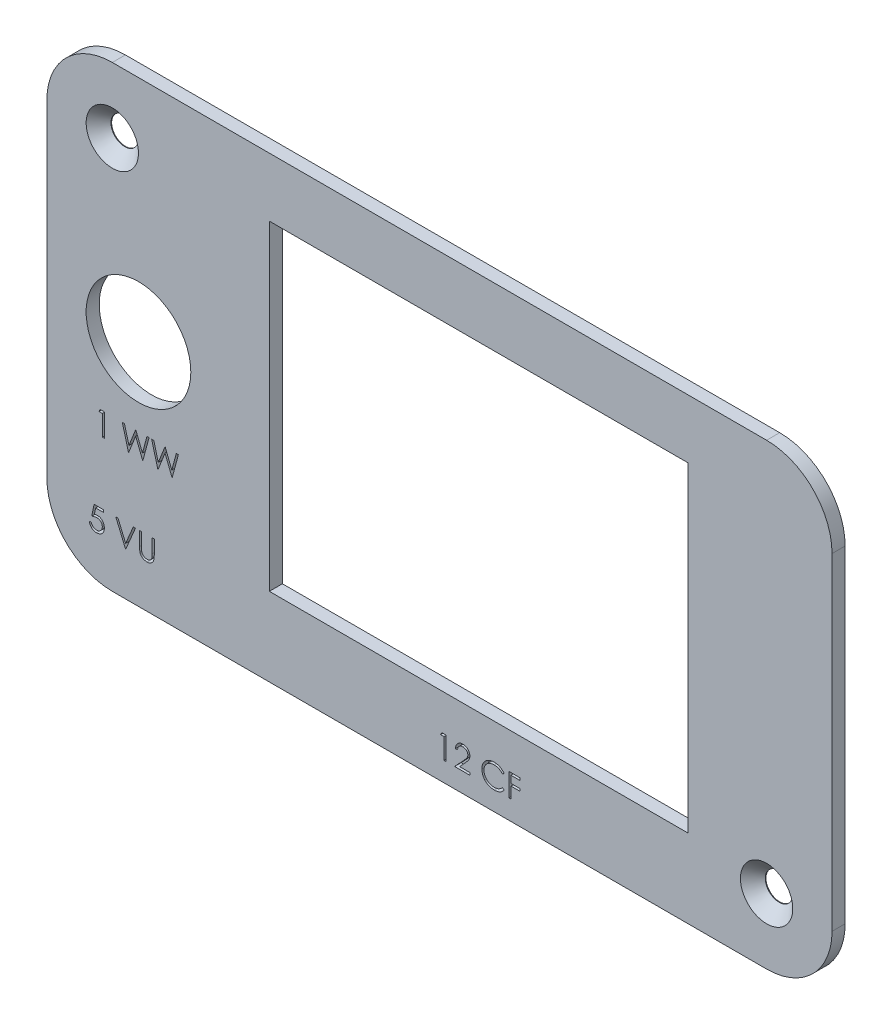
from build123d import *

# Parameters (mm, degrees)
ESQUISSE1_W             = 120
ESQUISSE1_H             = 70
BOSS_EXTRU_1_DEPTH      = 2
CONG_1_R                = 10
ESQUISSE2_R             = 2.1
ENL_V_MAT_EXTRU_1_DEPTH = 139.938835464
ESQUISSE3_R             = 8
ESQUISSE3_W             = 64
ESQUISSE3_H             = 49
ENL_V_MAT_EXTRU_3_DEPTH = 139.938835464
CHANFREIN1_SIZE         = 1.9
ENL_V_MAT_EXTRU_4_DEPTH = 1


with BuildPart() as part:
    # Esquisse1 → Boss.-Extru.1 (new body)
    with BuildSketch(Plane.XY):
        with Locations((60, 35)):
            Rectangle(ESQUISSE1_W, ESQUISSE1_H)
    extrude(amount=BOSS_EXTRU_1_DEPTH)

    # Cong_1
    cong_1_edges = [part.edges().sort_by_distance(p)[0] for p in [
        (0, 70, 1),
        (120, 70, 1),
        (120, 0, 1),
        (0, 0, 1),
    ]]
    fillet(cong_1_edges, radius=CONG_1_R)

    # Esquisse2 → Enl_v. mat.-Extru.1 (cut, through all)
    with BuildSketch(Plane.XY.offset(2)):
        with Locations((10, 60)):
            Circle(ESQUISSE2_R)
        with Locations((110, 10)):
            Circle(ESQUISSE2_R)
    extrude(amount=-ENL_V_MAT_EXTRU_1_DEPTH, mode=Mode.SUBTRACT)

    # Esquisse3 → Enl_v. mat.-Extru.3 (cut, through all)
    with BuildSketch(Plane.XY.offset(2)):
        with Locations((14, 35)):
            Circle(ESQUISSE3_R)
        with Locations((66, 36.5)):
            Rectangle(ESQUISSE3_W, ESQUISSE3_H)
    extrude(amount=-ENL_V_MAT_EXTRU_3_DEPTH, mode=Mode.SUBTRACT)

    # Chanfrein1
    chanfrein1_edges = [part.edges().sort_by_distance(p)[0] for p in [
        (7.9, 60, 2),
        (107.9, 10, 2),
    ]]
    chamfer(chanfrein1_edges, length=CHANFREIN1_SIZE)

    # Esquisse4 → Enl_v. mat.-Extru.4 (cut)
    with BuildSketch(Plane.XY.offset(2)):
        with BuildLine():
            Line((8.650617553, 10.129142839), (8.650617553, 9.77016848))
            Line((8.650617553, 9.77016848), (7.460112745, 9.77016848))
            Line((7.460112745, 9.77016848), (7.271510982, 8.849595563))
            add(Edge.make_bspline(
                [(7.271510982, 8.849595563), (7.308566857, 8.859825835), (7.380356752, 8.879645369), (7.486316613, 8.901651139), (7.586908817, 8.914916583), (7.652184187, 8.916727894), (7.683770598, 8.917604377)],
                knots=[0, 0, 0, 0, 1.100273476, 2.13160584, 3.095893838, 4, 4, 4, 4], degree=3))
            add(Edge.make_bspline(
                [(7.683770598, 8.917604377), (7.722854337, 8.916758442), (7.799702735, 8.915095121), (7.912141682, 8.899123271), (8.019474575, 8.873983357), (8.121476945, 8.838862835), (8.218337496, 8.793953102), (8.309165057, 8.737853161), (8.39532297, 8.67231983), (8.475265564, 8.596974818), (8.547789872, 8.514053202), (8.611555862, 8.42489533), (8.665718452, 8.330367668), (8.709279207, 8.22956706), (8.744063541, 8.123607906), (8.767215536, 8.011375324), (8.782632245, 7.893927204), (8.784354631, 7.813622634), (8.785232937, 7.772672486)],
                knots=[0, 0, 0, 0, 1.052922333, 2.070308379, 3.05430497, 4.020497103, 4.973039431, 5.925935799, 6.892292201, 7.88610001, 8.88166317, 9.857072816, 10.836096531, 11.812156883, 12.81219415, 13.836441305, 14.89672472, 16, 16, 16, 16], degree=3))
            add(Edge.make_bspline(
                [(8.785232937, 7.772672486), (8.784567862, 7.744150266), (8.783246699, 7.687491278), (8.776528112, 7.603347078), (8.763592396, 7.520984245), (8.746224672, 7.440391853), (8.723682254, 7.361722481), (8.6963932, 7.284750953), (8.662997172, 7.209956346), (8.626365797, 7.136630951), (8.585119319, 7.066432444), (8.539340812, 7.000783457), (8.49097532, 6.938699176), (8.438933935, 6.880845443), (8.38273294, 6.827602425), (8.323052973, 6.778654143), (8.260370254, 6.733172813), (8.193715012, 6.693004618), (8.124572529, 6.656041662), (8.051944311, 6.625718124), (7.977483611, 6.598607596), (7.900118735, 6.576998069), (7.820024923, 6.560065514), (7.737070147, 6.548564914), (7.651689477, 6.540188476), (7.593814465, 6.539664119), (7.564579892, 6.539399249)],
                knots=[0, 0, 0, 0, 1.056347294, 2.098418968, 3.122841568, 4.141288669, 5.149314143, 6.15115421, 7.162517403, 8.180376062, 9.185164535, 10.17417709, 11.141909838, 12.097768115, 13.052685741, 14.0056014, 14.954263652, 15.917497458, 16.885230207, 17.854509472, 18.828990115, 19.81800267, 20.826176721, 21.857883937, 22.917946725, 24, 24, 24, 24], degree=3))
            add(Edge.make_bspline(
                [(7.564579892, 6.539399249), (7.529705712, 6.540090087), (7.461094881, 6.541449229), (7.360574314, 6.555667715), (7.263859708, 6.576031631), (7.171729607, 6.606667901), (7.083358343, 6.645055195), (6.999935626, 6.693571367), (6.91932985, 6.748550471), (6.844817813, 6.813430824), (6.775661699, 6.884346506), (6.71375519, 6.961304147), (6.658621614, 7.043033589), (6.611143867, 7.129931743), (6.570645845, 7.221770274), (6.538830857, 7.318893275), (6.513152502, 7.420793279), (6.502289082, 7.490946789), (6.496771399, 7.526578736)],
                knots=[0, 0, 0, 0, 1.0467383, 2.05933395, 3.04377827, 4.011590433, 4.970194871, 5.932262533, 6.905835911, 7.896367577, 8.894135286, 9.877477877, 10.858688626, 11.851381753, 12.8477658, 13.868841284, 14.917554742, 16, 16, 16, 16], degree=3))
            Line((6.496771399, 7.526578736), (6.810873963, 7.526578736))
            add(Edge.make_bspline(
                [(6.810873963, 7.526578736), (6.81860252, 7.493202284), (6.833457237, 7.429050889), (6.866062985, 7.338919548), (6.905928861, 7.258600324), (6.953333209, 7.187030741), (7.00988324, 7.124621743), (7.074412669, 7.069004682), (7.146760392, 7.018829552), (7.227153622, 6.977006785), (7.311966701, 6.941338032), (7.400733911, 6.917586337), (7.491038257, 6.900885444), (7.552116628, 6.899213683), (7.582809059, 6.898373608)],
                knots=[0, 0, 0, 0, 1.136247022, 2.183929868, 3.172523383, 4.106158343, 5.02341133, 5.958108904, 6.928429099, 7.938127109, 8.96079061, 9.975095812, 10.982467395, 12, 12, 12, 12], degree=3))
            add(Edge.make_bspline(
                [(7.582809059, 6.898373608), (7.612767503, 6.899194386), (7.671755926, 6.900810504), (7.758567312, 6.913249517), (7.842380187, 6.932407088), (7.922367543, 6.961076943), (7.999929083, 6.995921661), (8.073102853, 7.040636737), (8.14400573, 7.092096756), (8.210433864, 7.151053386), (8.271273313, 7.21602308), (8.325029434, 7.285500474), (8.369806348, 7.35961732), (8.407540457, 7.437090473), (8.436193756, 7.51876903), (8.456634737, 7.604270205), (8.468637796, 7.693805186), (8.470288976, 7.754874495), (8.471130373, 7.7859938)],
                knots=[0, 0, 0, 0, 1.027316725, 2.022795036, 3.002884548, 3.971462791, 4.93288096, 5.914575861, 6.907176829, 7.935150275, 8.956128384, 9.956726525, 10.942570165, 11.921478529, 12.907843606, 13.90538589, 14.932640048, 16, 16, 16, 16], degree=3))
            add(Edge.make_bspline(
                [(8.471130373, 7.7859938), (8.470471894, 7.814069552), (8.469183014, 7.869023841), (8.458652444, 7.949423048), (8.440335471, 8.02549609), (8.414911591, 8.097610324), (8.382632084, 8.165833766), (8.343185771, 8.230236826), (8.295832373, 8.28997066), (8.241740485, 8.345063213), (8.182482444, 8.395908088), (8.117038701, 8.439252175), (8.046778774, 8.475716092), (7.972549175, 8.507184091), (7.892584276, 8.529784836), (7.808467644, 8.546752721), (7.719290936, 8.556568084), (7.658320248, 8.557929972), (7.626979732, 8.558630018)],
                knots=[0, 0, 0, 0, 1.045622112, 2.046656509, 3.013763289, 3.955457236, 4.890082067, 5.820317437, 6.762574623, 7.722996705, 8.69280354, 9.665887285, 10.63943826, 11.638615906, 12.663482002, 13.728887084, 14.832589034, 16, 16, 16, 16], degree=3))
            add(Edge.make_bspline(
                [(7.626979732, 8.558630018), (7.599850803, 8.558049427), (7.543836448, 8.556850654), (7.457913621, 8.548024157), (7.367621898, 8.533784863), (7.273307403, 8.514198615), (7.174686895, 8.488567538), (7.071968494, 8.457853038), (6.964936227, 8.421131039), (6.892818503, 8.393398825), (6.855745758, 8.379142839)],
                knots=[0, 0, 0, 0, 0.817624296, 1.688186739, 2.600797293, 3.572016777, 4.590301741, 5.671205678, 6.80286297, 8, 8, 8, 8], degree=3))
            Line((6.855745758, 8.379142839), (7.214720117, 10.129142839))
            Line((7.214720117, 10.129142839), (8.650617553, 10.129142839))
        make_face()
        Polygon((10.535232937, 10.129142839), (10.871771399, 10.129142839), (12.038438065, 7.370929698), (13.205104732, 10.129142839), (13.541643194, 10.129142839), (12.060873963, 6.629142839), (12.016002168, 6.629142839), align=None)
        with BuildLine():
            Line((14.169848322, 10.129142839), (14.483950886, 10.129142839))
            Line((14.483950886, 10.129142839), (14.483950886, 8.03208755))
            add(Edge.make_bspline(
                [(14.483950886, 8.03208755), (14.483904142, 8.002406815), (14.483815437, 7.946082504), (14.484407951, 7.865914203), (14.48606732, 7.794641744), (14.487113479, 7.731990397), (14.489440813, 7.678247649), (14.49133886, 7.633122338), (14.493779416, 7.596828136), (14.496712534, 7.57564721), (14.497973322, 7.566542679)],
                knots=[0, 0, 0, 0, 1.528628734, 2.90083645, 4.128790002, 5.200304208, 6.127813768, 6.898992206, 7.526736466, 8, 8, 8, 8], degree=3))
            add(Edge.make_bspline(
                [(14.497973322, 7.566542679), (14.503150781, 7.533695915), (14.513213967, 7.469853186), (14.538860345, 7.378944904), (14.574677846, 7.297013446), (14.617120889, 7.221502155), (14.6730535, 7.154512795), (14.740057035, 7.092801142), (14.821234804, 7.038829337), (14.911495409, 6.989478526), (15.008780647, 6.949813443), (15.108191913, 6.919820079), (15.208234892, 6.901541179), (15.275211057, 6.89942464), (15.308470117, 6.898373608)],
                knots=[0, 0, 0, 0, 1.035780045, 2.013197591, 2.933192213, 3.817615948, 4.702609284, 5.640816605, 6.646850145, 7.73207398, 8.84249596, 9.914020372, 10.964143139, 12, 12, 12, 12], degree=3))
            add(Edge.make_bspline(
                [(15.308470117, 6.898373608), (15.337023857, 6.899447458), (15.393966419, 6.901588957), (15.47857285, 6.914850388), (15.560972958, 6.938750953), (15.641573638, 6.969590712), (15.717124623, 7.010338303), (15.787668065, 7.057409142), (15.850631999, 7.112620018), (15.908089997, 7.173720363), (15.958124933, 7.242660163), (16.001496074, 7.317938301), (16.037022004, 7.400687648), (16.054565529, 7.45884207), (16.06357829, 7.488718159)],
                knots=[0, 0, 0, 0, 0.994687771, 1.983630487, 2.973142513, 3.978332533, 4.983357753, 5.956394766, 6.925816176, 7.893390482, 8.871859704, 9.88551698, 10.913711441, 12, 12, 12, 12], degree=3))
            add(Edge.make_bspline(
                [(16.06357829, 7.488718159), (16.066578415, 7.501066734), (16.073263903, 7.528584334), (16.079510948, 7.575105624), (16.086017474, 7.629994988), (16.090532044, 7.693646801), (16.094933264, 7.765847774), (16.097566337, 7.846974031), (16.09878337, 7.936730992), (16.09914605, 7.999368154), (16.099335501, 8.03208755)],
                knots=[0, 0, 0, 0, 0.558680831, 1.244966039, 2.062412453, 2.990489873, 4.051219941, 5.244515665, 6.560634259, 8, 8, 8, 8], degree=3))
            Line((16.099335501, 8.03208755), (16.099335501, 10.129142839))
            Line((16.099335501, 10.129142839), (16.413438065, 10.129142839))
            Line((16.413438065, 10.129142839), (16.413438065, 8.015260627))
            add(Edge.make_bspline(
                [(16.413438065, 8.015260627), (16.413183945, 7.977162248), (16.412688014, 7.902810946), (16.408387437, 7.793859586), (16.401530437, 7.690506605), (16.391842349, 7.592738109), (16.379005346, 7.500903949), (16.364730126, 7.414199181), (16.346550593, 7.333246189), (16.325317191, 7.257413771), (16.301043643, 7.185228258), (16.269602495, 7.116719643), (16.234177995, 7.049805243), (16.192163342, 6.985497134), (16.14495196, 6.923510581), (16.091500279, 6.864221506), (16.033576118, 6.80668246), (15.970216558, 6.752369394), (15.902466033, 6.702560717), (15.830526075, 6.658762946), (15.754949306, 6.621739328), (15.67593218, 6.591263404), (15.593440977, 6.568348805), (15.507473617, 6.551273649), (15.417834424, 6.541571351), (15.356869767, 6.540129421), (15.325998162, 6.539399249)],
                knots=[0, 0, 0, 0, 1.316592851, 2.569410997, 3.76748051, 4.895814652, 5.963796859, 6.97159953, 7.931736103, 8.829262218, 9.692595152, 10.560224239, 11.431080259, 12.30701507, 13.211635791, 14.121146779, 15.063487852, 16.031507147, 17.00238618, 17.966455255, 18.938106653, 19.907068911, 20.888905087, 21.893141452, 22.933117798, 24, 24, 24, 24], degree=3))
            add(Edge.make_bspline(
                [(15.325998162, 6.539399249), (15.292329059, 6.540184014), (15.2262704, 6.541723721), (15.128932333, 6.550546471), (15.035618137, 6.567164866), (14.94534226, 6.588324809), (14.859333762, 6.617508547), (14.776440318, 6.651606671), (14.698081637, 6.693483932), (14.622986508, 6.740077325), (14.553161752, 6.792501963), (14.489064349, 6.849642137), (14.430588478, 6.910582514), (14.378719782, 6.97598288), (14.332598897, 7.045334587), (14.292868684, 7.118833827), (14.25875544, 7.196452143), (14.241148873, 7.250405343), (14.232248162, 7.277680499)],
                knots=[0, 0, 0, 0, 1.13879206, 2.234305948, 3.301075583, 4.341971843, 5.366689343, 6.369221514, 7.369726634, 8.367512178, 9.355451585, 10.318319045, 11.268648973, 12.207971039, 13.137398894, 14.081662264, 15.030215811, 16, 16, 16, 16], degree=3))
            add(Edge.make_bspline(
                [(14.232248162, 7.277680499), (14.227071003, 7.296313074), (14.215841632, 7.336727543), (14.203816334, 7.403614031), (14.193707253, 7.480628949), (14.184201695, 7.567777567), (14.178592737, 7.665127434), (14.173675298, 7.77263635), (14.169813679, 7.890434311), (14.169836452, 7.972488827), (14.169848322, 8.015260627)],
                knots=[0, 0, 0, 0, 0.625038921, 1.35572334, 2.194682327, 3.136881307, 4.189498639, 5.346923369, 6.617055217, 8, 8, 8, 8], degree=3))
            Line((14.169848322, 8.015260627), (14.169848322, 10.129142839))
        make_face()
        Polygon((60.365717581, 6.478670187), (61.012852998, 6.478670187), (61.012852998, 2.978670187), (60.698750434, 2.978670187), (60.698750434, 6.119695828), (60.160288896, 6.119695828), align=None)
        with BuildLine():
            Line((62.762852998, 5.40174711), (62.448750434, 5.40174711))
            add(Edge.make_bspline(
                [(62.448750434, 5.40174711), (62.450797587, 5.443417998), (62.454818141, 5.525258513), (62.47364643, 5.644582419), (62.500587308, 5.758637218), (62.538678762, 5.866507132), (62.585985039, 5.969145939), (62.642715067, 6.066145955), (62.709908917, 6.157137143), (62.786115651, 6.241275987), (62.86888429, 6.318463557), (62.95819023, 6.3851188), (63.052035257, 6.441436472), (63.150134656, 6.488517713), (63.25359522, 6.523857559), (63.361478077, 6.550079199), (63.474257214, 6.565855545), (63.551097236, 6.56755133), (63.590176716, 6.568413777)],
                knots=[0, 0, 0, 0, 1.10065271, 2.161652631, 3.183658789, 4.190468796, 5.17591951, 6.163126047, 7.15150782, 8.156236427, 9.156009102, 10.134482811, 11.092018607, 12.041330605, 13.001268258, 13.972401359, 14.968799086, 16, 16, 16, 16], degree=3))
            add(Edge.make_bspline(
                [(63.590176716, 6.568413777), (63.62855479, 6.56751532), (63.703966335, 6.565749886), (63.814028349, 6.550588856), (63.918805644, 6.526843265), (64.01809341, 6.493527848), (64.111099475, 6.448743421), (64.198522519, 6.394945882), (64.28140333, 6.332726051), (64.356010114, 6.259472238), (64.424518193, 6.181269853), (64.483620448, 6.09778195), (64.534233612, 6.011552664), (64.576421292, 5.921924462), (64.60747743, 5.828053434), (64.631055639, 5.731306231), (64.644383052, 5.63068142), (64.646428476, 5.562574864), (64.647468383, 5.527949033)],
                knots=[0, 0, 0, 0, 1.111607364, 2.184268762, 3.212621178, 4.221274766, 5.211760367, 6.196651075, 7.1921475, 8.207485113, 9.220403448, 10.201281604, 11.166441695, 12.114753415, 13.065576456, 14.026450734, 14.996634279, 16, 16, 16, 16], degree=3))
            add(Edge.make_bspline(
                [(64.647468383, 5.527949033), (64.64577512, 5.479201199), (64.642418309, 5.382560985), (64.613703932, 5.240546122), (64.568857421, 5.102952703), (64.514860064, 4.992215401), (64.46038762, 4.902981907), (64.411300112, 4.829513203), (64.353835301, 4.750407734), (64.287156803, 4.665930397), (64.212643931, 4.575419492), (64.129621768, 4.478929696), (64.037498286, 4.377457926), (63.972839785, 4.308152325), (63.93933537, 4.272239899)],
                knots=[0, 0, 0, 0, 1.184426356, 2.348067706, 3.509069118, 4.696110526, 5.333549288, 6.050745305, 6.844228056, 7.710549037, 8.667450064, 9.695053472, 10.805634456, 12, 12, 12, 12], degree=3))
            Line((63.93933537, 4.272239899), (63.063634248, 3.337644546))
            Line((63.063634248, 3.337644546), (64.692340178, 3.337644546))
            Line((64.692340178, 3.337644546), (64.692340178, 2.978670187))
            Line((64.692340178, 2.978670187), (62.314135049, 2.978670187))
            Line((62.314135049, 2.978670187), (63.671506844, 4.427187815))
            add(Edge.make_bspline(
                [(63.671506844, 4.427187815), (63.704554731, 4.461686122), (63.768032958, 4.527950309), (63.857815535, 4.624693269), (63.938454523, 4.714442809), (64.010471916, 4.797029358), (64.072305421, 4.873660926), (64.127177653, 4.941855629), (64.171143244, 5.00461008), (64.21885864, 5.077350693), (64.265072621, 5.166163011), (64.304784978, 5.2746967), (64.328999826, 5.386423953), (64.331904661, 5.46192599), (64.333365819, 5.499904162)],
                knots=[0, 0, 0, 0, 1.329631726, 2.553950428, 3.673215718, 4.687767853, 5.603093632, 6.413772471, 7.123043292, 7.734684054, 8.834405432, 9.900288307, 10.943827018, 12, 12, 12, 12], degree=3))
            add(Edge.make_bspline(
                [(64.333365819, 5.499904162), (64.332730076, 5.52378556), (64.33147715, 5.57085121), (64.320419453, 5.639856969), (64.303708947, 5.706421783), (64.279763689, 5.770750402), (64.248156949, 5.832196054), (64.209683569, 5.890833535), (64.165293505, 5.9475225), (64.113942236, 6.000675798), (64.057530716, 6.049357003), (63.997936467, 6.092481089), (63.934886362, 6.1285202), (63.86864624, 6.158063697), (63.799400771, 6.181239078), (63.727016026, 6.197297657), (63.651692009, 6.207380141), (63.600258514, 6.208744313), (63.574050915, 6.209439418)],
                knots=[0, 0, 0, 0, 0.991446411, 1.95395049, 2.89581595, 3.838931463, 4.798493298, 5.75982156, 6.748411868, 7.785213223, 8.824556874, 9.840280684, 10.836137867, 11.835679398, 12.848801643, 13.863922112, 14.911575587, 16, 16, 16, 16], degree=3))
            add(Edge.make_bspline(
                [(63.574050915, 6.209439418), (63.546680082, 6.208724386), (63.492928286, 6.20732018), (63.414009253, 6.197497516), (63.338723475, 6.180551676), (63.266881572, 6.157375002), (63.198361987, 6.127916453), (63.133497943, 6.091224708), (63.072435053, 6.047441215), (63.01505853, 5.997800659), (62.962194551, 5.942533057), (62.915747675, 5.880923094), (62.875163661, 5.814095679), (62.839754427, 5.742231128), (62.810998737, 5.664677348), (62.789025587, 5.581709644), (62.77163874, 5.493688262), (62.76583022, 5.432903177), (62.762852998, 5.40174711)],
                knots=[0, 0, 0, 0, 1.031018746, 2.02475058, 2.990194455, 3.934040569, 4.864654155, 5.795059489, 6.735614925, 7.690564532, 8.649604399, 9.611025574, 10.590972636, 11.591080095, 12.624614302, 13.701020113, 14.821632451, 16, 16, 16, 16], degree=3))
        make_face()
        with BuildLine():
            Line((69.897468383, 5.836442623), (69.622628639, 5.626106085))
            add(Edge.make_bspline(
                [(69.622628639, 5.626106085), (69.603022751, 5.649472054), (69.564075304, 5.69588897), (69.501416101, 5.761068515), (69.436114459, 5.822133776), (69.368195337, 5.879375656), (69.296436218, 5.930792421), (69.222575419, 5.979063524), (69.145377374, 6.022331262), (69.038625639, 6.074794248), (68.898977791, 6.129540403), (68.723182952, 6.175443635), (68.539671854, 6.20466481), (68.414474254, 6.207829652), (68.350793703, 6.209439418)],
                knots=[0, 0, 0, 0, 0.757959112, 1.505699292, 2.245454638, 2.979532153, 3.711538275, 4.438200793, 5.171680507, 5.909471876, 7.393775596, 8.890124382, 10.418191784, 12, 12, 12, 12], degree=3))
            add(Edge.make_bspline(
                [(68.350793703, 6.209439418), (68.315710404, 6.209035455), (68.245869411, 6.20823128), (68.142220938, 6.197622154), (68.040507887, 6.182710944), (67.940796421, 6.160585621), (67.843213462, 6.132613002), (67.74712106, 6.099187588), (67.65391046, 6.057832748), (67.562292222, 6.012124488), (67.474513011, 5.960497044), (67.391457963, 5.904183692), (67.313429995, 5.843814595), (67.240367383, 5.779163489), (67.172195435, 5.710521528), (67.109408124, 5.637157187), (67.052222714, 5.559305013), (66.999505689, 5.477991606), (66.952292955, 5.393453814), (66.912763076, 5.305378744), (66.877757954, 5.215274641), (66.850058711, 5.12212348), (66.828134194, 5.026580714), (66.813006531, 4.928389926), (66.80251806, 4.827756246), (66.801717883, 4.759546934), (66.801314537, 4.725164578)],
                knots=[0, 0, 0, 0, 1.054917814, 2.100044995, 3.131103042, 4.146048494, 5.169673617, 6.183595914, 7.203665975, 8.234915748, 9.262203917, 10.264457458, 11.251630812, 12.227803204, 13.197192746, 14.159520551, 15.12972552, 16.100847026, 17.073214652, 18.039054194, 19.002613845, 19.979014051, 20.95965708, 21.949030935, 22.966165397, 24, 24, 24, 24], degree=3))
            add(Edge.make_bspline(
                [(66.801314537, 4.725164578), (66.802576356, 4.673433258), (66.80505377, 4.571865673), (66.827102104, 4.423095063), (66.860607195, 4.280574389), (66.910822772, 4.145194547), (66.972741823, 4.015286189), (67.050982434, 3.893047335), (67.141598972, 3.776630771), (67.245873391, 3.668787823), (67.360279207, 3.570274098), (67.483027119, 3.483523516), (67.613811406, 3.411208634), (67.751188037, 3.351032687), (67.896214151, 3.30477596), (68.048628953, 3.272211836), (68.208100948, 3.250969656), (68.317070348, 3.248935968), (68.372528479, 3.247900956)],
                knots=[0, 0, 0, 0, 1.029171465, 2.020641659, 2.987623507, 3.938342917, 4.889210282, 5.84687017, 6.821220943, 7.821438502, 8.827599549, 9.822697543, 10.807740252, 11.797342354, 12.80366471, 13.83203677, 14.896651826, 16, 16, 16, 16], degree=3))
            add(Edge.make_bspline(
                [(68.372528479, 3.247900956), (68.433631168, 3.249589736), (68.553895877, 3.252913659), (68.730263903, 3.281072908), (68.899099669, 3.326730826), (69.060412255, 3.390628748), (69.213746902, 3.473694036), (69.359343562, 3.574391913), (69.497325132, 3.693680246), (69.580296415, 3.784763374), (69.622628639, 3.83123429)],
                knots=[0, 0, 0, 0, 1.028121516, 2.023589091, 2.998037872, 3.967518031, 4.937445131, 5.927275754, 6.942489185, 8, 8, 8, 8], degree=3))
            Line((69.622628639, 3.83123429), (69.897468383, 3.623001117))
            add(Edge.make_bspline(
                [(69.897468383, 3.623001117), (69.875350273, 3.594462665), (69.831219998, 3.537522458), (69.759761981, 3.457250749), (69.684484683, 3.381746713), (69.604828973, 3.311619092), (69.521711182, 3.245464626), (69.433638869, 3.185162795), (69.341769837, 3.129871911), (69.246415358, 3.079244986), (69.147676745, 3.034327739), (69.04567231, 2.995873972), (68.940841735, 2.962749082), (68.833180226, 2.935497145), (68.722464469, 2.914226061), (68.609093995, 2.900006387), (68.49282412, 2.890264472), (68.414382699, 2.889376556), (68.374631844, 2.888926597)],
                knots=[0, 0, 0, 0, 0.986787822, 1.968848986, 2.935600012, 3.899624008, 4.868462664, 5.837806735, 6.815139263, 7.798259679, 8.787526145, 9.778297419, 10.776456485, 11.791383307, 12.812564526, 13.85620153, 14.913611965, 16, 16, 16, 16], degree=3))
            add(Edge.make_bspline(
                [(68.374631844, 2.888926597), (68.336988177, 2.88918859), (68.262552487, 2.889706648), (68.152653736, 2.898098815), (68.045664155, 2.909548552), (67.941889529, 2.926788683), (67.840763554, 2.947133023), (67.743202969, 2.97440428), (67.648247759, 3.004953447), (67.556279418, 3.040858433), (67.467219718, 3.081374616), (67.381355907, 3.127166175), (67.298727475, 3.177848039), (67.218522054, 3.23230305), (67.14192447, 3.292280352), (67.068270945, 3.356946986), (66.997148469, 3.426084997), (66.953145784, 3.47593985), (66.931022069, 3.501005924)],
                knots=[0, 0, 0, 0, 1.114604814, 2.203992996, 3.262667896, 4.300477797, 5.318619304, 6.316056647, 7.298880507, 8.271930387, 9.238335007, 10.195173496, 11.151986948, 12.108099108, 13.064862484, 14.031167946, 15.010108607, 16, 16, 16, 16], degree=3))
            add(Edge.make_bspline(
                [(66.931022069, 3.501005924), (66.895586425, 3.544547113), (66.825142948, 3.631103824), (66.735017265, 3.771389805), (66.65786971, 3.917858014), (66.595493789, 4.071277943), (66.546731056, 4.23130533), (66.512949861, 4.398020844), (66.490998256, 4.571268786), (66.488487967, 4.689105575), (66.487211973, 4.749002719)],
                knots=[0, 0, 0, 0, 0.994628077, 1.977248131, 2.950237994, 3.925870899, 4.908910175, 5.911660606, 6.938484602, 8, 8, 8, 8], degree=3))
            add(Edge.make_bspline(
                [(66.487211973, 4.749002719), (66.488767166, 4.811958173), (66.491826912, 4.935819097), (66.517822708, 5.117593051), (66.559641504, 5.291744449), (66.619038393, 5.457948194), (66.694343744, 5.617078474), (66.787370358, 5.767919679), (66.8970375, 5.911436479), (67.022485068, 6.04545123), (67.160052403, 6.167990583), (67.307371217, 6.275796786), (67.464153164, 6.365514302), (67.628671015, 6.440510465), (67.802156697, 6.498154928), (67.984240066, 6.538508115), (68.174578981, 6.563625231), (68.304441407, 6.566800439), (68.370425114, 6.568413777)],
                knots=[0, 0, 0, 0, 1.032925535, 2.032216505, 3.007276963, 3.968222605, 4.92396291, 5.891752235, 6.871517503, 7.883894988, 8.900124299, 9.891468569, 10.874487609, 11.85992873, 12.854644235, 13.869047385, 14.917252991, 16, 16, 16, 16], degree=3))
            add(Edge.make_bspline(
                [(68.370425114, 6.568413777), (68.410639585, 6.567931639), (68.490240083, 6.566977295), (68.607992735, 6.557671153), (68.722635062, 6.542157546), (68.834246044, 6.521041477), (68.94336866, 6.494834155), (69.049168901, 6.460693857), (69.152267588, 6.421657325), (69.252014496, 6.37669886), (69.347931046, 6.326232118), (69.439987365, 6.270816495), (69.527452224, 6.210520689), (69.610941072, 6.145857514), (69.689057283, 6.075458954), (69.764018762, 6.001261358), (69.83327984, 5.921127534), (69.876033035, 5.8647226), (69.897468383, 5.836442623)],
                knots=[0, 0, 0, 0, 1.096760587, 2.17092713, 3.219439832, 4.250915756, 5.268269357, 6.278326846, 7.281116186, 8.274029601, 9.260640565, 10.235837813, 11.203064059, 12.156899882, 13.114053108, 14.069676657, 15.032185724, 16, 16, 16, 16], degree=3))
        make_face()
        Polygon((70.615417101, 6.478670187), (72.320545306, 6.478670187), (72.320545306, 6.119695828), (70.929519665, 6.119695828), (70.929519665, 5.042772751), (72.320545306, 5.042772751), (72.320545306, 4.683798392), (70.929519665, 4.683798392), (70.929519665, 2.978670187), (70.615417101, 2.978670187), align=None)
        Polygon((8.148087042, 23.143871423), (8.795222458, 23.143871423), (8.795222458, 19.643871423), (8.481119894, 19.643871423), (8.481119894, 22.784897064), (7.942658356, 22.784897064), align=None)
        Polygon((11.532401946, 23.143871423), (11.857021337, 23.143871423), (12.54201733, 20.577064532), (13.560747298, 23.143871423), (13.606320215, 23.143871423), (14.606119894, 20.594592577), (15.294621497, 23.143871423), (15.615735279, 23.143871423), (14.672025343, 19.643871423), (14.627153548, 19.643871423), (13.574068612, 22.320754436), (12.508363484, 19.643871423), (12.463491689, 19.643871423), align=None)
        Polygon((16.019581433, 23.143871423), (16.344200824, 23.143871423), (17.029196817, 20.577064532), (18.047926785, 23.143871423), (18.093499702, 23.143871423), (19.093299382, 20.594592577), (19.781800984, 23.143871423), (20.102914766, 23.143871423), (19.15920483, 19.643871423), (19.114333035, 19.643871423), (18.061248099, 22.320754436), (16.995542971, 19.643871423), (16.950671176, 19.643871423), align=None)
    extrude(amount=-ENL_V_MAT_EXTRU_4_DEPTH, mode=Mode.SUBTRACT)


solid = part.part
